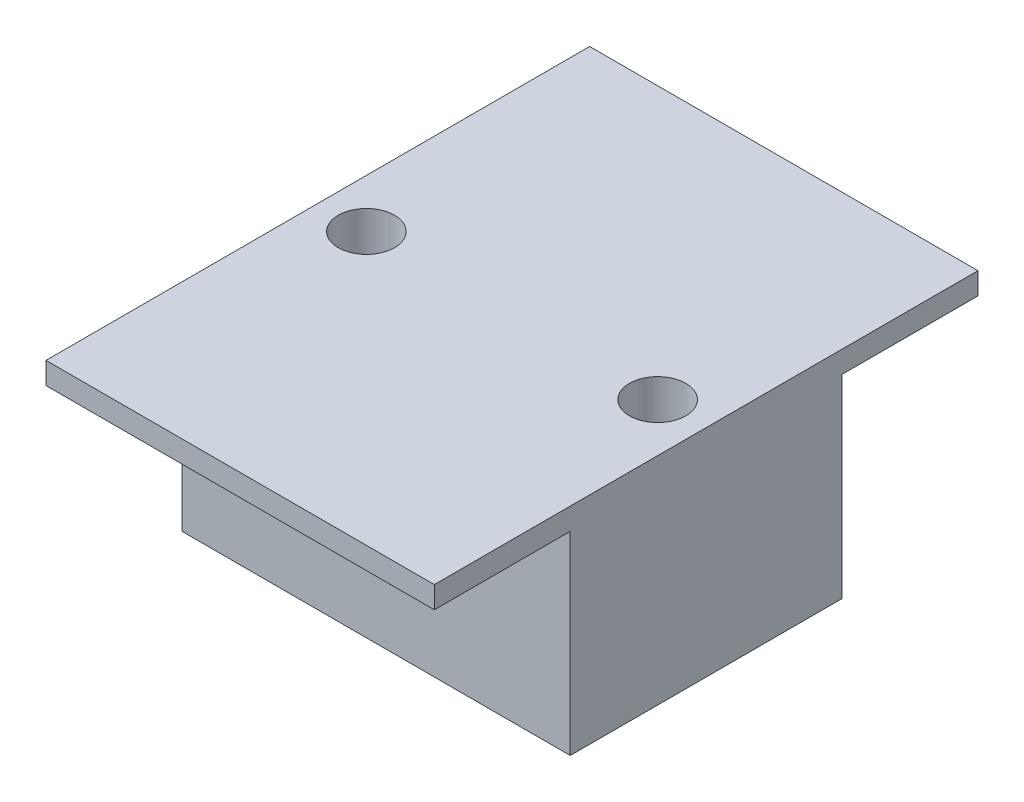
ISO-10303-21;
HEADER;
FILE_DESCRIPTION(('STEP AP214'),'2;1');
FILE_NAME('part.step','',(''),(''),'','','');
FILE_SCHEMA(('AUTOMOTIVE_DESIGN { 1 0 10303 214 1 1 1 1 }'));
ENDSEC;
DATA;
#1=APPLICATION_CONTEXT('core data for automotive mechanical design processes');
#2=APPLICATION_PROTOCOL_DEFINITION('international standard','automotive_design',2000,#1);
#3=PRODUCT_CONTEXT('',#1,'mechanical');
#4=PRODUCT('Part','Part','',(#3));
#5=PRODUCT_RELATED_PRODUCT_CATEGORY('part','',(#4));
#6=PRODUCT_DEFINITION_FORMATION('','',#4);
#7=PRODUCT_DEFINITION_CONTEXT('part definition',#1,'design');
#8=PRODUCT_DEFINITION('design','',#6,#7);
#9=PRODUCT_DEFINITION_SHAPE('','',#8);
#10=(LENGTH_UNIT() NAMED_UNIT(*) SI_UNIT(.MILLI.,.METRE.));
#11=(NAMED_UNIT(*) PLANE_ANGLE_UNIT() SI_UNIT($,.RADIAN.));
#12=(NAMED_UNIT(*) SI_UNIT($,.STERADIAN.) SOLID_ANGLE_UNIT());
#13=UNCERTAINTY_MEASURE_WITH_UNIT(LENGTH_MEASURE(1.E-05),#10,'distance_accuracy_value','');
#14=(GEOMETRIC_REPRESENTATION_CONTEXT(3) GLOBAL_UNCERTAINTY_ASSIGNED_CONTEXT((#13)) GLOBAL_UNIT_ASSIGNED_CONTEXT((#10,
#11,#12)) REPRESENTATION_CONTEXT('',''));
#15=CARTESIAN_POINT('',(0.,0.,0.));
#16=DIRECTION('',(0.,0.,1.));
#17=DIRECTION('',(1.,0.,0.));
#18=AXIS2_PLACEMENT_3D('',#15,#16,#17);
#19=CARTESIAN_POINT('',(0.,0.,0.));
#20=DIRECTION('',(0.,1.,0.));
#21=DIRECTION('',(0.,0.,1.));
#22=AXIS2_PLACEMENT_3D('',#19,#20,#21);
#23=PLANE('',#22);
#24=DIRECTION('',(1.,0.,0.));
#25=VECTOR('',#24,1.);
#26=CARTESIAN_POINT('',(0.,0.,-7.));
#27=LINE('',#26,#25);
#28=CARTESIAN_POINT('',(-10.,0.,-7.));
#29=VERTEX_POINT('',#28);
#30=CARTESIAN_POINT('',(10.,0.,-7.));
#31=VERTEX_POINT('',#30);
#32=EDGE_CURVE('E74',#29,#31,#27,.T.);
#33=ORIENTED_EDGE('',*,*,#32,.F.);
#34=DIRECTION('',(0.,0.,1.));
#35=VECTOR('',#34,1.);
#36=CARTESIAN_POINT('',(-10.,0.,-14.));
#37=LINE('',#36,#35);
#38=CARTESIAN_POINT('',(-10.,0.,-14.));
#39=VERTEX_POINT('',#38);
#40=EDGE_CURVE('E193',#39,#29,#37,.T.);
#41=ORIENTED_EDGE('',*,*,#40,.F.);
#42=DIRECTION('',(-1.,0.,0.));
#43=VECTOR('',#42,1.);
#44=CARTESIAN_POINT('',(9.99999999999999,0.,-14.));
#45=LINE('',#44,#43);
#46=CARTESIAN_POINT('',(9.99999999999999,0.,-14.));
#47=VERTEX_POINT('',#46);
#48=EDGE_CURVE('E166',#47,#39,#45,.T.);
#49=ORIENTED_EDGE('',*,*,#48,.F.);
#50=DIRECTION('',(0.,0.,1.));
#51=VECTOR('',#50,1.);
#52=CARTESIAN_POINT('',(9.99999999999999,0.,-14.));
#53=LINE('',#52,#51);
#54=EDGE_CURVE('E178',#47,#31,#53,.T.);
#55=ORIENTED_EDGE('',*,*,#54,.T.);
#56=EDGE_LOOP('',(#33,#41,#49,#55));
#57=FACE_BOUND('',#56,.T.);
#58=ADVANCED_FACE('F45',(#57),#23,.F.);
#59=CARTESIAN_POINT('',(9.99999999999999,1.125,-14.));
#60=DIRECTION('',(0.,0.,1.));
#61=DIRECTION('',(1.,0.,0.));
#62=AXIS2_PLACEMENT_3D('',#59,#60,#61);
#63=PLANE('',#62);
#64=ORIENTED_EDGE('',*,*,#48,.T.);
#65=DIRECTION('',(0.,-1.,0.));
#66=VECTOR('',#65,1.);
#67=CARTESIAN_POINT('',(-10.,1.125,-14.));
#68=LINE('',#67,#66);
#69=CARTESIAN_POINT('',(-10.,1.125,-14.));
#70=VERTEX_POINT('',#69);
#71=EDGE_CURVE('E11',#70,#39,#68,.T.);
#72=ORIENTED_EDGE('',*,*,#71,.F.);
#73=DIRECTION('',(-1.,0.,0.));
#74=VECTOR('',#73,1.);
#75=CARTESIAN_POINT('',(9.99999999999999,1.125,-14.));
#76=LINE('',#75,#74);
#77=CARTESIAN_POINT('',(9.99999999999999,1.125,-14.));
#78=VERTEX_POINT('',#77);
#79=EDGE_CURVE('E173',#78,#70,#76,.T.);
#80=ORIENTED_EDGE('',*,*,#79,.F.);
#81=DIRECTION('',(0.,-1.,0.));
#82=VECTOR('',#81,1.);
#83=CARTESIAN_POINT('',(9.99999999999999,1.125,-14.));
#84=LINE('',#83,#82);
#85=EDGE_CURVE('E189',#78,#47,#84,.T.);
#86=ORIENTED_EDGE('',*,*,#85,.T.);
#87=EDGE_LOOP('',(#64,#72,#80,#86));
#88=FACE_BOUND('',#87,.T.);
#89=ADVANCED_FACE('F47',(#88),#63,.F.);
#90=CARTESIAN_POINT('',(-10.,1.125,-14.));
#91=DIRECTION('',(1.,0.,0.));
#92=DIRECTION('',(0.,0.,-1.));
#93=AXIS2_PLACEMENT_3D('',#90,#91,#92);
#94=PLANE('',#93);
#95=ORIENTED_EDGE('',*,*,#40,.T.);
#96=DIRECTION('',(0.,1.,0.));
#97=VECTOR('',#96,1.);
#98=CARTESIAN_POINT('',(-10.,-10.,-7.));
#99=LINE('',#98,#97);
#100=CARTESIAN_POINT('',(-10.,-10.,-7.));
#101=VERTEX_POINT('',#100);
#102=EDGE_CURVE('E167',#101,#29,#99,.T.);
#103=ORIENTED_EDGE('',*,*,#102,.F.);
#104=DIRECTION('',(0.,0.,-1.));
#105=VECTOR('',#104,1.);
#106=CARTESIAN_POINT('',(-10.,-10.,0.));
#107=LINE('',#106,#105);
#108=CARTESIAN_POINT('',(-10.,-10.,7.));
#109=VERTEX_POINT('',#108);
#110=EDGE_CURVE('E134',#109,#101,#107,.T.);
#111=ORIENTED_EDGE('',*,*,#110,.F.);
#112=DIRECTION('',(0.,1.,0.));
#113=VECTOR('',#112,1.);
#114=CARTESIAN_POINT('',(-10.,-10.,7.));
#115=LINE('',#114,#113);
#116=CARTESIAN_POINT('',(-10.,0.,7.));
#117=VERTEX_POINT('',#116);
#118=EDGE_CURVE('E146',#109,#117,#115,.T.);
#119=ORIENTED_EDGE('',*,*,#118,.T.);
#120=CARTESIAN_POINT('',(-10.,0.,14.));
#121=VERTEX_POINT('',#120);
#122=EDGE_CURVE('E64',#117,#121,#37,.T.);
#123=ORIENTED_EDGE('',*,*,#122,.T.);
#124=DIRECTION('',(0.,-1.,0.));
#125=VECTOR('',#124,1.);
#126=CARTESIAN_POINT('',(-10.,1.125,14.));
#127=LINE('',#126,#125);
#128=CARTESIAN_POINT('',(-10.,1.125,14.));
#129=VERTEX_POINT('',#128);
#130=EDGE_CURVE('E54',#129,#121,#127,.T.);
#131=ORIENTED_EDGE('',*,*,#130,.F.);
#132=DIRECTION('',(0.,0.,1.));
#133=VECTOR('',#132,1.);
#134=CARTESIAN_POINT('',(-10.,1.125,-14.));
#135=LINE('',#134,#133);
#136=EDGE_CURVE('E177',#70,#129,#135,.T.);
#137=ORIENTED_EDGE('',*,*,#136,.F.);
#138=ORIENTED_EDGE('',*,*,#71,.T.);
#139=EDGE_LOOP('',(#95,#103,#111,#119,#123,#131,#137,#138));
#140=FACE_BOUND('',#139,.T.);
#141=ADVANCED_FACE('F220',(#140),#94,.F.);
#142=CARTESIAN_POINT('',(10.,1.125,14.));
#143=DIRECTION('',(0.,0.,1.));
#144=DIRECTION('',(1.,0.,0.));
#145=AXIS2_PLACEMENT_3D('',#142,#143,#144);
#146=PLANE('',#145);
#147=DIRECTION('',(-1.,0.,0.));
#148=VECTOR('',#147,1.);
#149=CARTESIAN_POINT('',(10.,0.,14.));
#150=LINE('',#149,#148);
#151=CARTESIAN_POINT('',(10.,0.,14.));
#152=VERTEX_POINT('',#151);
#153=EDGE_CURVE('E196',#152,#121,#150,.T.);
#154=ORIENTED_EDGE('',*,*,#153,.F.);
#155=DIRECTION('',(0.,-1.,0.));
#156=VECTOR('',#155,1.);
#157=CARTESIAN_POINT('',(10.,1.125,14.));
#158=LINE('',#157,#156);
#159=CARTESIAN_POINT('',(10.,1.125,14.));
#160=VERTEX_POINT('',#159);
#161=EDGE_CURVE('E203',#160,#152,#158,.T.);
#162=ORIENTED_EDGE('',*,*,#161,.F.);
#163=DIRECTION('',(-1.,0.,0.));
#164=VECTOR('',#163,1.);
#165=CARTESIAN_POINT('',(10.,1.125,14.));
#166=LINE('',#165,#164);
#167=EDGE_CURVE('E181',#160,#129,#166,.T.);
#168=ORIENTED_EDGE('',*,*,#167,.T.);
#169=ORIENTED_EDGE('',*,*,#130,.T.);
#170=EDGE_LOOP('',(#154,#162,#168,#169));
#171=FACE_BOUND('',#170,.T.);
#172=ADVANCED_FACE('F210',(#171),#146,.T.);
#173=CARTESIAN_POINT('',(9.99999999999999,1.125,-14.));
#174=DIRECTION('',(1.,0.,0.));
#175=DIRECTION('',(0.,0.,-1.));
#176=AXIS2_PLACEMENT_3D('',#173,#174,#175);
#177=PLANE('',#176);
#178=ORIENTED_EDGE('',*,*,#54,.F.);
#179=ORIENTED_EDGE('',*,*,#85,.F.);
#180=DIRECTION('',(0.,0.,1.));
#181=VECTOR('',#180,1.);
#182=CARTESIAN_POINT('',(9.99999999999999,1.125,-14.));
#183=LINE('',#182,#181);
#184=EDGE_CURVE('E185',#78,#160,#183,.T.);
#185=ORIENTED_EDGE('',*,*,#184,.T.);
#186=ORIENTED_EDGE('',*,*,#161,.T.);
#187=CARTESIAN_POINT('',(10.,0.,7.));
#188=VERTEX_POINT('',#187);
#189=EDGE_CURVE('E128',#188,#152,#53,.T.);
#190=ORIENTED_EDGE('',*,*,#189,.F.);
#191=DIRECTION('',(0.,1.,0.));
#192=VECTOR('',#191,1.);
#193=CARTESIAN_POINT('',(10.,-10.,7.));
#194=LINE('',#193,#192);
#195=CARTESIAN_POINT('',(10.,-10.,7.));
#196=VERTEX_POINT('',#195);
#197=EDGE_CURVE('E121',#196,#188,#194,.T.);
#198=ORIENTED_EDGE('',*,*,#197,.F.);
#199=DIRECTION('',(0.,0.,-1.));
#200=VECTOR('',#199,1.);
#201=CARTESIAN_POINT('',(10.,-10.,0.));
#202=LINE('',#201,#200);
#203=CARTESIAN_POINT('',(10.,-10.,-7.));
#204=VERTEX_POINT('',#203);
#205=EDGE_CURVE('E126',#196,#204,#202,.T.);
#206=ORIENTED_EDGE('',*,*,#205,.T.);
#207=DIRECTION('',(0.,1.,0.));
#208=VECTOR('',#207,1.);
#209=CARTESIAN_POINT('',(10.,-10.,-7.));
#210=LINE('',#209,#208);
#211=EDGE_CURVE('E133',#204,#31,#210,.T.);
#212=ORIENTED_EDGE('',*,*,#211,.T.);
#213=EDGE_LOOP('',(#178,#179,#185,#186,#190,#198,#206,#212));
#214=FACE_BOUND('',#213,.T.);
#215=ADVANCED_FACE('F124',(#214),#177,.T.);
#216=CARTESIAN_POINT('',(0.,1.125,0.));
#217=DIRECTION('',(0.,1.,0.));
#218=DIRECTION('',(0.,0.,1.));
#219=AXIS2_PLACEMENT_3D('',#216,#217,#218);
#220=PLANE('',#219);
#221=CARTESIAN_POINT('',(-7.5,1.125,0.));
#222=DIRECTION('',(0.,-1.,0.));
#223=DIRECTION('',(0.,0.,-1.));
#224=AXIS2_PLACEMENT_3D('',#221,#222,#223);
#225=CIRCLE('',#224,1.45);
#226=CARTESIAN_POINT('',(-7.5,1.125,-1.45));
#227=VERTEX_POINT('',#226);
#228=EDGE_CURVE('E162',#227,#227,#225,.T.);
#229=ORIENTED_EDGE('',*,*,#228,.T.);
#230=EDGE_LOOP('',(#229));
#231=FACE_BOUND('',#230,.T.);
#232=CARTESIAN_POINT('',(7.5,1.125,0.));
#233=DIRECTION('',(0.,-1.,0.));
#234=DIRECTION('',(0.,0.,-1.));
#235=AXIS2_PLACEMENT_3D('',#232,#233,#234);
#236=CIRCLE('',#235,1.45);
#237=CARTESIAN_POINT('',(7.5,1.125,-1.45));
#238=VERTEX_POINT('',#237);
#239=EDGE_CURVE('E257',#238,#238,#236,.T.);
#240=ORIENTED_EDGE('',*,*,#239,.T.);
#241=EDGE_LOOP('',(#240));
#242=FACE_BOUND('',#241,.T.);
#243=ORIENTED_EDGE('',*,*,#79,.T.);
#244=ORIENTED_EDGE('',*,*,#136,.T.);
#245=ORIENTED_EDGE('',*,*,#167,.F.);
#246=ORIENTED_EDGE('',*,*,#184,.F.);
#247=EDGE_LOOP('',(#243,#244,#245,#246));
#248=FACE_BOUND('',#247,.T.);
#249=ADVANCED_FACE('F217',(#231,#242,#248),#220,.T.);
#250=ORIENTED_EDGE('',*,*,#122,.F.);
#251=DIRECTION('',(1.,0.,0.));
#252=VECTOR('',#251,1.);
#253=CARTESIAN_POINT('',(0.,0.,7.));
#254=LINE('',#253,#252);
#255=EDGE_CURVE('E151',#117,#188,#254,.T.);
#256=ORIENTED_EDGE('',*,*,#255,.T.);
#257=ORIENTED_EDGE('',*,*,#189,.T.);
#258=ORIENTED_EDGE('',*,*,#153,.T.);
#259=EDGE_LOOP('',(#250,#256,#257,#258));
#260=FACE_BOUND('',#259,.T.);
#261=ADVANCED_FACE('F213',(#260),#23,.F.);
#262=CARTESIAN_POINT('',(0.,-10.,7.));
#263=DIRECTION('',(0.,0.,1.));
#264=DIRECTION('',(1.,0.,0.));
#265=AXIS2_PLACEMENT_3D('',#262,#263,#264);
#266=PLANE('',#265);
#267=ORIENTED_EDGE('',*,*,#255,.F.);
#268=ORIENTED_EDGE('',*,*,#118,.F.);
#269=DIRECTION('',(1.,0.,0.));
#270=VECTOR('',#269,1.);
#271=CARTESIAN_POINT('',(0.,-10.,7.));
#272=LINE('',#271,#270);
#273=EDGE_CURVE('E139',#109,#196,#272,.T.);
#274=ORIENTED_EDGE('',*,*,#273,.T.);
#275=ORIENTED_EDGE('',*,*,#197,.T.);
#276=EDGE_LOOP('',(#267,#268,#274,#275));
#277=FACE_BOUND('',#276,.T.);
#278=ADVANCED_FACE('F145',(#277),#266,.T.);
#279=CARTESIAN_POINT('',(0.,-10.,-7.));
#280=DIRECTION('',(0.,0.,1.));
#281=DIRECTION('',(1.,0.,0.));
#282=AXIS2_PLACEMENT_3D('',#279,#280,#281);
#283=PLANE('',#282);
#284=ORIENTED_EDGE('',*,*,#32,.T.);
#285=ORIENTED_EDGE('',*,*,#211,.F.);
#286=DIRECTION('',(1.,0.,0.));
#287=VECTOR('',#286,1.);
#288=CARTESIAN_POINT('',(0.,-10.,-7.));
#289=LINE('',#288,#287);
#290=EDGE_CURVE('E141',#101,#204,#289,.T.);
#291=ORIENTED_EDGE('',*,*,#290,.F.);
#292=ORIENTED_EDGE('',*,*,#102,.T.);
#293=EDGE_LOOP('',(#284,#285,#291,#292));
#294=FACE_BOUND('',#293,.T.);
#295=ADVANCED_FACE('F225',(#294),#283,.F.);
#296=CARTESIAN_POINT('',(0.,-10.,0.));
#297=DIRECTION('',(0.,1.,0.));
#298=DIRECTION('',(0.,0.,1.));
#299=AXIS2_PLACEMENT_3D('',#296,#297,#298);
#300=PLANE('',#299);
#301=CARTESIAN_POINT('',(-7.5,-10.,0.));
#302=DIRECTION('',(0.,-1.,0.));
#303=DIRECTION('',(0.,0.,-1.));
#304=AXIS2_PLACEMENT_3D('',#301,#302,#303);
#305=CIRCLE('',#304,1.45);
#306=CARTESIAN_POINT('',(-7.5,-10.,-1.45));
#307=VERTEX_POINT('',#306);
#308=EDGE_CURVE('E260',#307,#307,#305,.T.);
#309=ORIENTED_EDGE('',*,*,#308,.F.);
#310=EDGE_LOOP('',(#309));
#311=FACE_BOUND('',#310,.T.);
#312=CARTESIAN_POINT('',(7.5,-10.,0.));
#313=DIRECTION('',(0.,-1.,0.));
#314=DIRECTION('',(0.,0.,-1.));
#315=AXIS2_PLACEMENT_3D('',#312,#313,#314);
#316=CIRCLE('',#315,1.45);
#317=CARTESIAN_POINT('',(7.5,-10.,-1.45));
#318=VERTEX_POINT('',#317);
#319=EDGE_CURVE('E154',#318,#318,#316,.T.);
#320=ORIENTED_EDGE('',*,*,#319,.F.);
#321=EDGE_LOOP('',(#320));
#322=FACE_BOUND('',#321,.T.);
#323=ORIENTED_EDGE('',*,*,#273,.F.);
#324=ORIENTED_EDGE('',*,*,#110,.T.);
#325=ORIENTED_EDGE('',*,*,#290,.T.);
#326=ORIENTED_EDGE('',*,*,#205,.F.);
#327=EDGE_LOOP('',(#323,#324,#325,#326));
#328=FACE_BOUND('',#327,.T.);
#329=ADVANCED_FACE('F138',(#311,#322,#328),#300,.F.);
#330=CARTESIAN_POINT('',(7.5,1.125,0.));
#331=DIRECTION('',(0.,-1.,0.));
#332=DIRECTION('',(0.,0.,-1.));
#333=AXIS2_PLACEMENT_3D('',#330,#331,#332);
#334=CYLINDRICAL_SURFACE('',#333,1.45);
#335=ORIENTED_EDGE('',*,*,#239,.F.);
#336=EDGE_LOOP('',(#335));
#337=FACE_BOUND('',#336,.T.);
#338=ORIENTED_EDGE('',*,*,#319,.T.);
#339=EDGE_LOOP('',(#338));
#340=FACE_BOUND('',#339,.T.);
#341=ADVANCED_FACE('F233',(#337,#340),#334,.F.);
#342=CARTESIAN_POINT('',(-7.5,1.125,0.));
#343=DIRECTION('',(0.,-1.,0.));
#344=DIRECTION('',(0.,0.,-1.));
#345=AXIS2_PLACEMENT_3D('',#342,#343,#344);
#346=CYLINDRICAL_SURFACE('',#345,1.45);
#347=ORIENTED_EDGE('',*,*,#228,.F.);
#348=EDGE_LOOP('',(#347));
#349=FACE_BOUND('',#348,.T.);
#350=ORIENTED_EDGE('',*,*,#308,.T.);
#351=EDGE_LOOP('',(#350));
#352=FACE_BOUND('',#351,.T.);
#353=ADVANCED_FACE('F272',(#349,#352),#346,.F.);
#354=CLOSED_SHELL('',(#58,#89,#141,#172,#215,#249,#261,#278,#295,#329,#341,#353));
#355=MANIFOLD_SOLID_BREP('B2',#354);
#356=ADVANCED_BREP_SHAPE_REPRESENTATION('',(#18,#355),#14);
#357=SHAPE_DEFINITION_REPRESENTATION(#9,#356);
ENDSEC;
END-ISO-10303-21;
